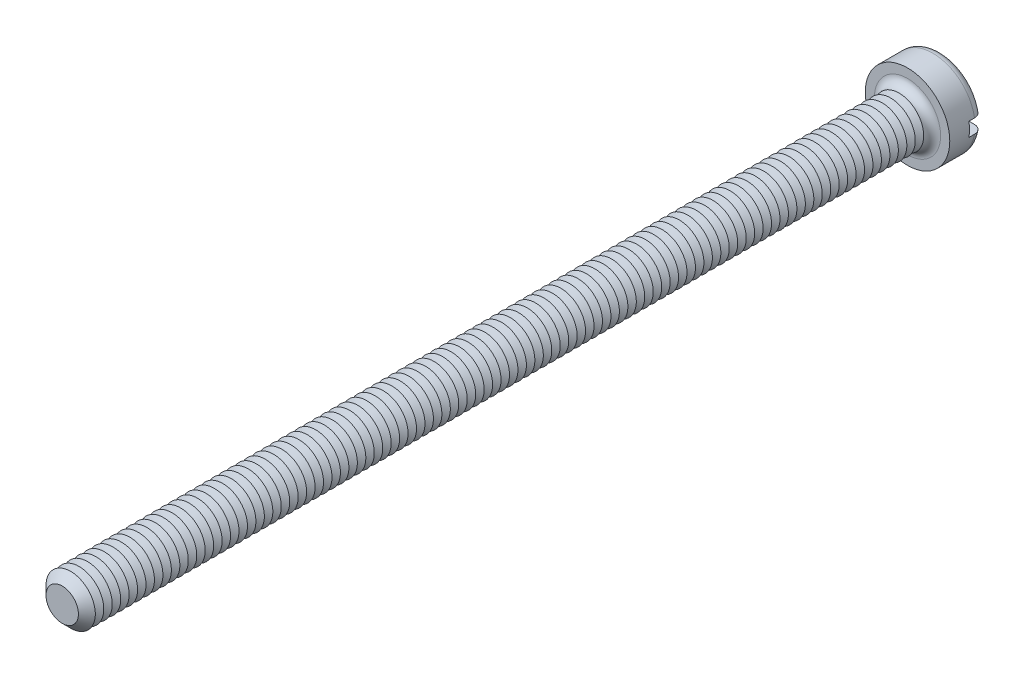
from build123d import *

# Parameters (mm, degrees)
SKETCH3_R           = 3
BOSS_EXTRUDE2_DEPTH = 2.4
SKETCH4_R           = 1.75
BOSS_EXTRUDE3_DEPTH = 60
FILLET1_R           = 0.6
CHAMFER1_SIZE       = 0.6
LPATTERN1_COUNT     = 98
LPATTERN1_PITCH     = 0.6
SKETCH8_W           = 6
SKETCH8_H           = 1
CUT_EXTRUDE1_DEPTH  = 1


with BuildPart() as part:
    # Sketch3 → Boss-Extrude2 (new body)
    with BuildSketch(Plane.XY):
        Circle(SKETCH3_R)
    extrude(amount=-BOSS_EXTRUDE2_DEPTH)

    # Sketch4 → Boss-Extrude3 (add)
    with BuildSketch(Plane.XY):
        Circle(SKETCH4_R)
    extrude(amount=BOSS_EXTRUDE3_DEPTH)

    # Fillet1
    fillet1_edges = [part.edges().sort_by_distance(p)[0] for p in [
        (-3, 0, -2.4),
        (-1.75, 0, 0),
    ]]
    fillet(fillet1_edges, radius=FILLET1_R)

    # Chamfer1
    chamfer1_edges = [part.edges().sort_by_distance(p)[0] for p in [
        (-1.75, 0, 60),
    ]]
    chamfer(chamfer1_edges, length=CHAMFER1_SIZE)

    # Sketch6 → Cut-Revolve1 (revolve, cut)
    with BuildSketch(Plane(origin=(0, 0, 0), x_dir=(0, 0, -1), z_dir=(1, 0, 0)), mode=Mode.PRIVATE) as cut_revolve1_sk:
        Polygon((-0.6, 1.75), (-0.9, 1.230384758), (-1.2, 1.75), align=None)
    cut_revolve1 = revolve(cut_revolve1_sk.sketch.rotate(Axis((0, 0, -1.694361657), (0, 0, 1)), 90), axis=Axis((0, 0, -1.694361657), (0, 0, 1)), mode=Mode.SUBTRACT)

    # LPattern1: Cut-Revolve1 ×98
    with Locations(*[(0, 0, i * LPATTERN1_PITCH) for i in range(1, LPATTERN1_COUNT)]):
        add(cut_revolve1, mode=Mode.SUBTRACT)

    # Sketch8 → Cut-Extrude1 (cut)
    with BuildSketch(Plane(origin=(0, 0, -2.4), x_dir=(-1, 0, 0), z_dir=(0, 0, -1))):
        Rectangle(SKETCH8_W, SKETCH8_H)
    extrude(amount=-CUT_EXTRUDE1_DEPTH, mode=Mode.SUBTRACT)


solid = part.part
